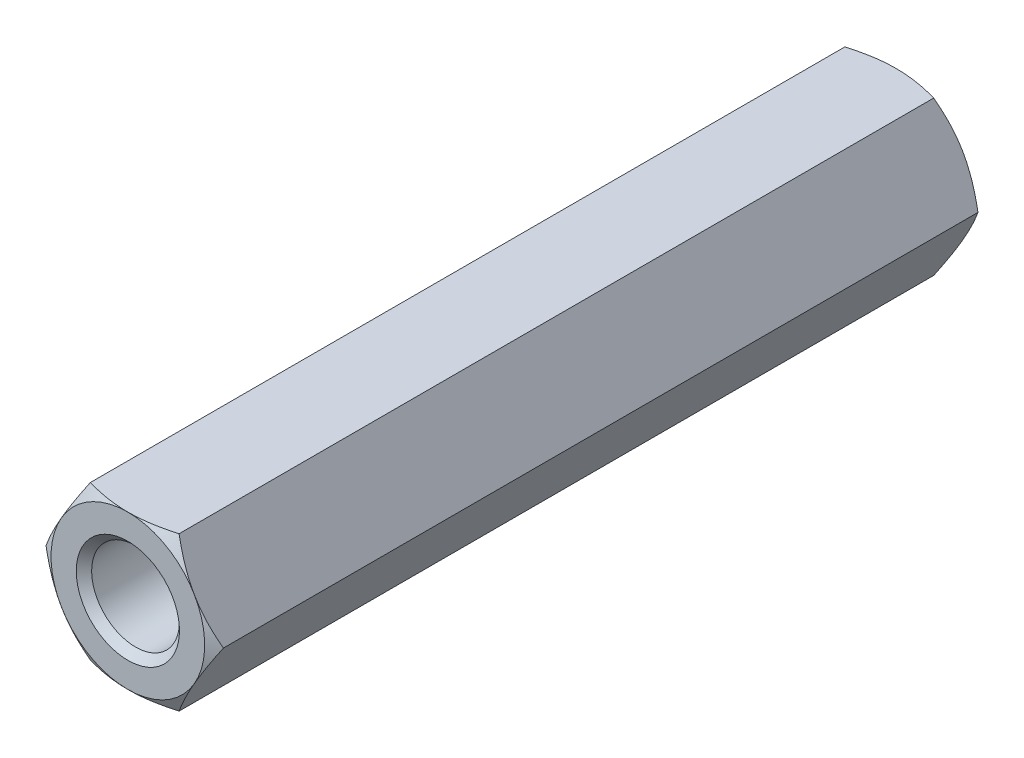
from build123d import *

# Parameters (mm, degrees)
BOSS_EXTRUDE1_DEPTH      = 17.5
SKETCH2_OUTSIDE_W        = 81.036
SKETCH2_OUTSIDE_H        = 79.954
SKETCH2_OUTSIDE_R        = 3.5
CUT_EXTRUDE1_DEPTH       = 19.298451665
CUT_EXTRUDE1_DRAFT       = -60
SKETCH3_R                = 2
SKETCH3_R_2              = 1.65
CUT_EXTRUDE2_DEPTH       = 10
SKETCH3_2_R              = 1.65
CUT_EXTRUDE3_DEPTH       = 11.05
CHAMFER1_SIZE            = 0.35
MIRROR1_COPY_1_SKETCH_W  = 81.036
MIRROR1_COPY_1_SKETCH_H  = 79.954
MIRROR1_COPY_1_SKETCH_R  = 3.5
MIRROR1_COPY_1_DEPTH     = 19.298451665
MIRROR1_COPY_1_DRAFT     = -60
CHAMFER1_OF_MIRROR1_SIZE = 0.35


with BuildPart() as part:
    # Sketch1 → Boss-Extrude1 (new body)
    with BuildSketch(Plane.XY):
        Polygon((2.020725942, 3.5), (-2.020725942, 3.5), (-4.041451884, 0), (-2.020725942, -3.5), (2.020725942, -3.5), (4.041451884, 0), align=None)
    boss_extrude1 = extrude(amount=-BOSS_EXTRUDE1_DEPTH)


with BuildPart() as cut_extrude1_tool:
    # Sketch2 outside → Cut-Extrude1 (with draft: the straight prism first)
    with BuildSketch(Plane(origin=(0, 0, -17.5), x_dir=(-1, 0, 0), z_dir=(0, 0, -1))):
        Rectangle(SKETCH2_OUTSIDE_W, SKETCH2_OUTSIDE_H)
        Circle(SKETCH2_OUTSIDE_R, mode=Mode.SUBTRACT)
    extrude(amount=-CUT_EXTRUDE1_DEPTH)
    # Cut-Extrude1: the draft: its side faces are tilted about the plane it starts from
    cut_extrude1_sides = [cut_extrude1_tool.faces().sort_by_distance(p)[0] for p in [
        (0, -39.977, -7.850774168),
        (-40.518, 0, -7.850774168),
        (0, 39.977, -7.850774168),
        (40.518, 0, -7.850774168),
        (3.5, 0, -7.850774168),
    ]]
    draft(cut_extrude1_sides, Plane(origin=(0, 0, -17.5), x_dir=(-1, 0, 0), z_dir=(0, 0, -1)), CUT_EXTRUDE1_DRAFT)


with BuildPart() as part_1:
    add(part.part)

    # Cut-Extrude1: cut by cut_extrude1_tool
    add(cut_extrude1_tool.part, mode=Mode.SUBTRACT)

    # Sketch3 → Cut-Extrude2 (cut)
    with BuildSketch(Plane(origin=(0, 0, -17.5), x_dir=(-1, 0, 0), z_dir=(0, 0, -1))):
        Circle(SKETCH3_R)
        Circle(SKETCH3_R_2, mode=Mode.SUBTRACT)
    cut_extrude2 = extrude(amount=-CUT_EXTRUDE2_DEPTH, mode=Mode.SUBTRACT)

    # Sketch3_2 → Cut-Extrude3 (cut)
    with BuildSketch(Plane(origin=(0, 0, -17.5), x_dir=(-1, 0, 0), z_dir=(0, 0, -1))):
        Circle(SKETCH3_2_R)
    cut_extrude3 = extrude(amount=-CUT_EXTRUDE3_DEPTH, mode=Mode.SUBTRACT)

    # Cut-Extrude4 cone 1 section (on through the dimple's axis) → Cut-Extrude4 (revolve, cut)
    with BuildSketch(Plane(origin=(0, 0, -6.45), x_dir=(0, 1, 0), z_dir=(1, 0, 0))):
        Polygon((0, 0), (1.65, 0), (0, 0.952627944), align=None)
    revolve(axis=Axis((0, 0, -6.45), (0, 0, 1)), mode=Mode.SUBTRACT)

    # Chamfer1
    chamfer1_edges = [part_1.edges().sort_by_distance(p)[0] for p in [
        (2, 0, -17.5),
    ]]
    chamfer(chamfer1_edges, length=CHAMFER1_SIZE)

    # Mirror1: Boss-Extrude1, Cut-Extrude2, Cut-Extrude3 across plane
    add(boss_extrude1.mirror(Plane.XY))
    add(cut_extrude2.mirror(Plane.XY), mode=Mode.SUBTRACT)
    add(cut_extrude3.mirror(Plane.XY), mode=Mode.SUBTRACT)


with BuildPart() as mirror1_copy_1_tool:
    # Mirror1 copy 1 sketch → Mirror1 copy 1 (with draft: the straight prism first)
    with BuildSketch(Plane(origin=(0, 0, 17.5), x_dir=(-1, 0, 0), z_dir=(0, 0, 1))):
        Rectangle(MIRROR1_COPY_1_SKETCH_W, MIRROR1_COPY_1_SKETCH_H)
        Circle(MIRROR1_COPY_1_SKETCH_R, mode=Mode.SUBTRACT)
    extrude(amount=-MIRROR1_COPY_1_DEPTH)
    # Mirror1 copy 1: the draft: its side faces are tilted about the plane it starts from
    mirror1_copy_1_sides = [mirror1_copy_1_tool.faces().sort_by_distance(p)[0] for p in [
        (0, -39.977, 7.850774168),
        (-40.518, 0, 7.850774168),
        (0, 39.977, 7.850774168),
        (40.518, 0, 7.850774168),
        (3.5, 0, 7.850774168),
    ]]
    draft(mirror1_copy_1_sides, Plane(origin=(0, 0, 17.5), x_dir=(-1, 0, 0), z_dir=(0, 0, 1)), MIRROR1_COPY_1_DRAFT)


with BuildPart() as part_2:
    add(part_1.part)

    # Mirror1 copy 1: cut by mirror1_copy_1_tool
    add(mirror1_copy_1_tool.part, mode=Mode.SUBTRACT)

    # Chamfer1 of Mirror1
    chamfer1_of_mirror1_edges = [part_2.edges().sort_by_distance(p)[0] for p in [
        (2, 0, 17.5),
    ]]
    chamfer(chamfer1_of_mirror1_edges, length=CHAMFER1_OF_MIRROR1_SIZE)


solid = part_2.part
